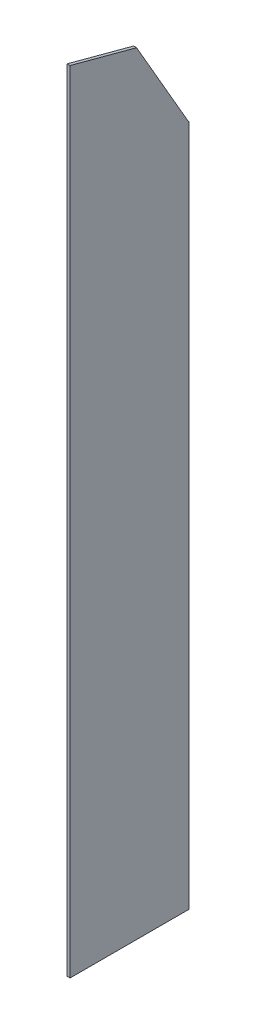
from build123d import *

# Parameters (mm, degrees)
SKETCH1_W               = 19.05
SKETCH1_H               = 762
BOSS_EXTRUDE1_DEPTH     = 5101.6125
CHAMFER2_SIZE           = 6
CUT_EXTRUDE1_DEPTH      = 5116.828557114
CUT_EXTRUDE1_DEPTH_BACK = 5116.828557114


with BuildPart() as part:
    # Sketch1 → Boss-Extrude1 (new body)
    with BuildSketch(Plane(origin=(0, 0, 0), x_dir=(-1, 0, 0), z_dir=(0, 1, 0))):
        Rectangle(SKETCH1_W, SKETCH1_H)
    extrude(amount=BOSS_EXTRUDE1_DEPTH)

    # Chamfer2
    chamfer2_edges = [part.edges().sort_by_distance(p)[0] for p in [
        (0, 0, -381),
        (9.525, 0, 0),
        (0, 0, 381),
        (-9.525, 0, 0),
    ]]
    chamfer(chamfer2_edges, length=CHAMFER2_SIZE)

    # Sketch2 → Cut-Extrude1 (cut, two sides: drawn at the far end of the back side and taken through both)
    with BuildSketch(Plane.YZ.offset(-CUT_EXTRUDE1_DEPTH_BACK)):
        Polygon((5101.6125, 485.605005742), (5101.6125, -381), (4380.429711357, -381), (4380.429711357, -379.700961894), (4959.30710999, -45.485939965), align=None)
    extrude(amount=CUT_EXTRUDE1_DEPTH + CUT_EXTRUDE1_DEPTH_BACK, mode=Mode.SUBTRACT)


solid = part.part
